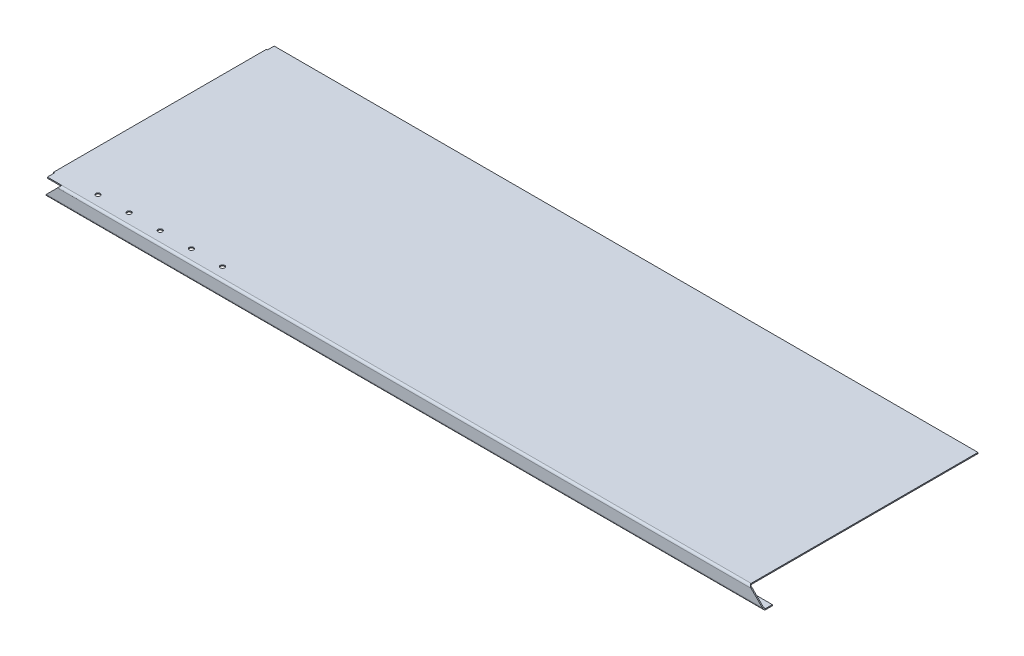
ISO-10303-21;
HEADER;
FILE_DESCRIPTION(('STEP AP214'),'2;1');
FILE_NAME('part.step','',(''),(''),'','','');
FILE_SCHEMA(('AUTOMOTIVE_DESIGN { 1 0 10303 214 1 1 1 1 }'));
ENDSEC;
DATA;
#1=APPLICATION_CONTEXT('core data for automotive mechanical design processes');
#2=APPLICATION_PROTOCOL_DEFINITION('international standard','automotive_design',2000,#1);
#3=PRODUCT_CONTEXT('',#1,'mechanical');
#4=PRODUCT('Part','Part','',(#3));
#5=PRODUCT_RELATED_PRODUCT_CATEGORY('part','',(#4));
#6=PRODUCT_DEFINITION_FORMATION('','',#4);
#7=PRODUCT_DEFINITION_CONTEXT('part definition',#1,'design');
#8=PRODUCT_DEFINITION('design','',#6,#7);
#9=PRODUCT_DEFINITION_SHAPE('','',#8);
#10=(LENGTH_UNIT() NAMED_UNIT(*) SI_UNIT(.MILLI.,.METRE.));
#11=(NAMED_UNIT(*) PLANE_ANGLE_UNIT() SI_UNIT($,.RADIAN.));
#12=(NAMED_UNIT(*) SI_UNIT($,.STERADIAN.) SOLID_ANGLE_UNIT());
#13=UNCERTAINTY_MEASURE_WITH_UNIT(LENGTH_MEASURE(1.E-05),#10,'distance_accuracy_value','');
#14=(GEOMETRIC_REPRESENTATION_CONTEXT(3) GLOBAL_UNCERTAINTY_ASSIGNED_CONTEXT((#13)) GLOBAL_UNIT_ASSIGNED_CONTEXT((#10,
#11,#12)) REPRESENTATION_CONTEXT('',''));
#15=CARTESIAN_POINT('',(0.,0.,0.));
#16=DIRECTION('',(0.,0.,1.));
#17=DIRECTION('',(1.,0.,0.));
#18=AXIS2_PLACEMENT_3D('',#15,#16,#17);
#19=CARTESIAN_POINT('',(0.,-3.048,0.));
#20=DIRECTION('',(0.,1.,0.));
#21=DIRECTION('',(0.,0.,1.));
#22=AXIS2_PLACEMENT_3D('',#19,#20,#21);
#23=PLANE('',#22);
#24=CARTESIAN_POINT('',(119.0625,-3.048,619.125));
#25=DIRECTION('',(0.,1.,0.));
#26=DIRECTION('',(0.,0.,1.));
#27=AXIS2_PLACEMENT_3D('',#24,#25,#26);
#28=CIRCLE('',#27,6.34999999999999);
#29=CARTESIAN_POINT('',(119.0625,-3.048,625.475));
#30=VERTEX_POINT('',#29);
#31=EDGE_CURVE('E878',#30,#30,#28,.T.);
#32=ORIENTED_EDGE('',*,*,#31,.T.);
#33=EDGE_LOOP('',(#32));
#34=FACE_BOUND('',#33,.T.);
#35=CARTESIAN_POINT('',(474.6625,-3.04800000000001,619.125));
#36=DIRECTION('',(0.,1.,0.));
#37=DIRECTION('',(0.,0.,1.));
#38=AXIS2_PLACEMENT_3D('',#35,#36,#37);
#39=CIRCLE('',#38,6.34999999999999);
#40=CARTESIAN_POINT('',(474.6625,-3.04800000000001,625.475));
#41=VERTEX_POINT('',#40);
#42=EDGE_CURVE('E887',#41,#41,#39,.T.);
#43=ORIENTED_EDGE('',*,*,#42,.T.);
#44=EDGE_LOOP('',(#43));
#45=FACE_BOUND('',#44,.T.);
#46=CARTESIAN_POINT('',(385.7625,-3.04800000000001,619.125));
#47=DIRECTION('',(0.,1.,0.));
#48=DIRECTION('',(0.,0.,1.));
#49=AXIS2_PLACEMENT_3D('',#46,#47,#48);
#50=CIRCLE('',#49,6.34999999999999);
#51=CARTESIAN_POINT('',(385.7625,-3.04800000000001,625.475));
#52=VERTEX_POINT('',#51);
#53=EDGE_CURVE('E897',#52,#52,#50,.T.);
#54=ORIENTED_EDGE('',*,*,#53,.T.);
#55=EDGE_LOOP('',(#54));
#56=FACE_BOUND('',#55,.T.);
#57=CARTESIAN_POINT('',(296.8625,-3.048,619.125));
#58=DIRECTION('',(0.,1.,0.));
#59=DIRECTION('',(0.,0.,1.));
#60=AXIS2_PLACEMENT_3D('',#57,#58,#59);
#61=CIRCLE('',#60,6.34999999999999);
#62=CARTESIAN_POINT('',(296.8625,-3.048,625.475));
#63=VERTEX_POINT('',#62);
#64=EDGE_CURVE('E896',#63,#63,#61,.T.);
#65=ORIENTED_EDGE('',*,*,#64,.T.);
#66=EDGE_LOOP('',(#65));
#67=FACE_BOUND('',#66,.T.);
#68=CARTESIAN_POINT('',(207.9625,-3.048,619.125));
#69=DIRECTION('',(0.,1.,0.));
#70=DIRECTION('',(0.,0.,1.));
#71=AXIS2_PLACEMENT_3D('',#68,#69,#70);
#72=CIRCLE('',#71,6.34999999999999);
#73=CARTESIAN_POINT('',(207.9625,-3.048,625.475));
#74=VERTEX_POINT('',#73);
#75=EDGE_CURVE('E258',#74,#74,#72,.T.);
#76=ORIENTED_EDGE('',*,*,#75,.T.);
#77=EDGE_LOOP('',(#76));
#78=FACE_BOUND('',#77,.T.);
#79=DIRECTION('',(-1.,0.,0.));
#80=VECTOR('',#79,1.);
#81=CARTESIAN_POINT('',(0.,-3.048,627.1895));
#82=LINE('',#81,#80);
#83=CARTESIAN_POINT('',(3.04800000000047,-3.048,627.1895));
#84=VERTEX_POINT('',#83);
#85=CARTESIAN_POINT('',(4.64905891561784E-13,-3.048,627.1895));
#86=VERTEX_POINT('',#85);
#87=EDGE_CURVE('E219',#84,#86,#82,.T.);
#88=ORIENTED_EDGE('',*,*,#87,.T.);
#89=DIRECTION('',(0.,0.,1.));
#90=VECTOR('',#89,1.);
#91=CARTESIAN_POINT('',(4.64905891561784E-13,-3.048,0.));
#92=LINE('',#91,#90);
#93=CARTESIAN_POINT('',(4.64905891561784E-13,-3.048,19.05));
#94=VERTEX_POINT('',#93);
#95=EDGE_CURVE('E245',#94,#86,#92,.T.);
#96=ORIENTED_EDGE('',*,*,#95,.F.);
#97=DIRECTION('',(1.,0.,0.));
#98=VECTOR('',#97,1.);
#99=CARTESIAN_POINT('',(0.,-3.048,19.05));
#100=LINE('',#99,#98);
#101=CARTESIAN_POINT('',(3.04800000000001,-3.048,19.05));
#102=VERTEX_POINT('',#101);
#103=EDGE_CURVE('E112',#94,#102,#100,.T.);
#104=ORIENTED_EDGE('',*,*,#103,.T.);
#105=DIRECTION('',(0.,0.,-1.));
#106=VECTOR('',#105,1.);
#107=CARTESIAN_POINT('',(3.048,-3.048,0.));
#108=LINE('',#107,#106);
#109=CARTESIAN_POINT('',(3.048,-3.048,0.));
#110=VERTEX_POINT('',#109);
#111=EDGE_CURVE('E254',#102,#110,#108,.T.);
#112=ORIENTED_EDGE('',*,*,#111,.T.);
#113=DIRECTION('',(-1.,0.,0.));
#114=VECTOR('',#113,1.);
#115=CARTESIAN_POINT('',(0.,-3.048,0.));
#116=LINE('',#115,#114);
#117=CARTESIAN_POINT('',(2012.95,-3.048,0.));
#118=VERTEX_POINT('',#117);
#119=EDGE_CURVE('E13',#118,#110,#116,.T.);
#120=ORIENTED_EDGE('',*,*,#119,.F.);
#121=DIRECTION('',(0.,0.,1.));
#122=VECTOR('',#121,1.);
#123=CARTESIAN_POINT('',(2012.95,-3.048,0.));
#124=LINE('',#123,#122);
#125=CARTESIAN_POINT('',(2012.95,-3.04800000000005,647.827));
#126=VERTEX_POINT('',#125);
#127=EDGE_CURVE('E327',#126,#118,#124,.F.);
#128=ORIENTED_EDGE('',*,*,#127,.F.);
#129=DIRECTION('',(-1.,0.,0.));
#130=VECTOR('',#129,1.);
#131=CARTESIAN_POINT('',(0.,-3.04800000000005,647.827));
#132=LINE('',#131,#130);
#133=CARTESIAN_POINT('',(44.4500000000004,-3.048,647.827));
#134=VERTEX_POINT('',#133);
#135=EDGE_CURVE('E418',#134,#126,#132,.F.);
#136=ORIENTED_EDGE('',*,*,#135,.F.);
#137=DIRECTION('',(1.,0.,0.));
#138=VECTOR('',#137,1.);
#139=CARTESIAN_POINT('',(4.64905891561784E-13,-3.048,647.827));
#140=LINE('',#139,#138);
#141=CARTESIAN_POINT('',(3.04800000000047,-3.048,647.827));
#142=VERTEX_POINT('',#141);
#143=EDGE_CURVE('E278',#142,#134,#140,.T.);
#144=ORIENTED_EDGE('',*,*,#143,.F.);
#145=DIRECTION('',(0.,0.,-1.));
#146=VECTOR('',#145,1.);
#147=CARTESIAN_POINT('',(3.04800000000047,-3.048,0.));
#148=LINE('',#147,#146);
#149=EDGE_CURVE('E238',#142,#84,#148,.T.);
#150=ORIENTED_EDGE('',*,*,#149,.T.);
#151=EDGE_LOOP('',(#88,#96,#104,#112,#120,#128,#136,#144,#150));
#152=FACE_BOUND('',#151,.T.);
#153=ADVANCED_FACE('F88',(#34,#45,#56,#67,#78,#152),#23,.F.);
#154=CARTESIAN_POINT('',(0.,0.,0.));
#155=DIRECTION('',(0.,1.,0.));
#156=DIRECTION('',(0.,0.,1.));
#157=AXIS2_PLACEMENT_3D('',#154,#155,#156);
#158=PLANE('',#157);
#159=CARTESIAN_POINT('',(119.0625,0.,619.125));
#160=DIRECTION('',(0.,1.,0.));
#161=DIRECTION('',(0.,0.,1.));
#162=AXIS2_PLACEMENT_3D('',#159,#160,#161);
#163=CIRCLE('',#162,6.34999999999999);
#164=CARTESIAN_POINT('',(119.0625,0.,625.475));
#165=VERTEX_POINT('',#164);
#166=EDGE_CURVE('E876',#165,#165,#163,.T.);
#167=ORIENTED_EDGE('',*,*,#166,.F.);
#168=EDGE_LOOP('',(#167));
#169=FACE_BOUND('',#168,.T.);
#170=CARTESIAN_POINT('',(474.6625,0.,619.125));
#171=DIRECTION('',(0.,1.,0.));
#172=DIRECTION('',(0.,0.,1.));
#173=AXIS2_PLACEMENT_3D('',#170,#171,#172);
#174=CIRCLE('',#173,6.34999999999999);
#175=CARTESIAN_POINT('',(474.6625,0.,625.475));
#176=VERTEX_POINT('',#175);
#177=EDGE_CURVE('E880',#176,#176,#174,.T.);
#178=ORIENTED_EDGE('',*,*,#177,.F.);
#179=EDGE_LOOP('',(#178));
#180=FACE_BOUND('',#179,.T.);
#181=CARTESIAN_POINT('',(385.7625,0.,619.125));
#182=DIRECTION('',(0.,1.,0.));
#183=DIRECTION('',(0.,0.,1.));
#184=AXIS2_PLACEMENT_3D('',#181,#182,#183);
#185=CIRCLE('',#184,6.34999999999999);
#186=CARTESIAN_POINT('',(385.7625,0.,625.475));
#187=VERTEX_POINT('',#186);
#188=EDGE_CURVE('E917',#187,#187,#185,.T.);
#189=ORIENTED_EDGE('',*,*,#188,.F.);
#190=EDGE_LOOP('',(#189));
#191=FACE_BOUND('',#190,.T.);
#192=CARTESIAN_POINT('',(296.8625,0.,619.125));
#193=DIRECTION('',(0.,1.,0.));
#194=DIRECTION('',(0.,0.,1.));
#195=AXIS2_PLACEMENT_3D('',#192,#193,#194);
#196=CIRCLE('',#195,6.34999999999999);
#197=CARTESIAN_POINT('',(296.8625,0.,625.475));
#198=VERTEX_POINT('',#197);
#199=EDGE_CURVE('E892',#198,#198,#196,.T.);
#200=ORIENTED_EDGE('',*,*,#199,.F.);
#201=EDGE_LOOP('',(#200));
#202=FACE_BOUND('',#201,.T.);
#203=CARTESIAN_POINT('',(207.9625,0.,619.125));
#204=DIRECTION('',(0.,1.,0.));
#205=DIRECTION('',(0.,0.,1.));
#206=AXIS2_PLACEMENT_3D('',#203,#204,#205);
#207=CIRCLE('',#206,6.34999999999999);
#208=CARTESIAN_POINT('',(207.9625,0.,625.475));
#209=VERTEX_POINT('',#208);
#210=EDGE_CURVE('E901',#209,#209,#207,.T.);
#211=ORIENTED_EDGE('',*,*,#210,.F.);
#212=EDGE_LOOP('',(#211));
#213=FACE_BOUND('',#212,.T.);
#214=DIRECTION('',(0.,0.,-1.));
#215=VECTOR('',#214,1.);
#216=CARTESIAN_POINT('',(4.64905891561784E-13,0.,0.));
#217=LINE('',#216,#215);
#218=CARTESIAN_POINT('',(4.64905891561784E-13,0.,627.1895));
#219=VERTEX_POINT('',#218);
#220=CARTESIAN_POINT('',(4.64905891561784E-13,0.,19.05));
#221=VERTEX_POINT('',#220);
#222=EDGE_CURVE('E230',#219,#221,#217,.T.);
#223=ORIENTED_EDGE('',*,*,#222,.F.);
#224=DIRECTION('',(1.,0.,0.));
#225=VECTOR('',#224,1.);
#226=CARTESIAN_POINT('',(0.,0.,627.1895));
#227=LINE('',#226,#225);
#228=CARTESIAN_POINT('',(3.04800000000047,0.,627.1895));
#229=VERTEX_POINT('',#228);
#230=EDGE_CURVE('E104',#229,#219,#227,.F.);
#231=ORIENTED_EDGE('',*,*,#230,.F.);
#232=DIRECTION('',(0.,0.,1.));
#233=VECTOR('',#232,1.);
#234=CARTESIAN_POINT('',(3.04800000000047,0.,0.));
#235=LINE('',#234,#233);
#236=CARTESIAN_POINT('',(3.04800000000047,0.,647.827));
#237=VERTEX_POINT('',#236);
#238=EDGE_CURVE('E210',#237,#229,#235,.F.);
#239=ORIENTED_EDGE('',*,*,#238,.F.);
#240=DIRECTION('',(1.,0.,0.));
#241=VECTOR('',#240,1.);
#242=CARTESIAN_POINT('',(4.64905891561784E-13,0.,647.827));
#243=LINE('',#242,#241);
#244=CARTESIAN_POINT('',(44.4500000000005,0.,647.827));
#245=VERTEX_POINT('',#244);
#246=EDGE_CURVE('E275',#237,#245,#243,.T.);
#247=ORIENTED_EDGE('',*,*,#246,.T.);
#248=DIRECTION('',(-1.,0.,0.));
#249=VECTOR('',#248,1.);
#250=CARTESIAN_POINT('',(0.,0.,647.827));
#251=LINE('',#250,#249);
#252=CARTESIAN_POINT('',(2012.95,0.,647.827));
#253=VERTEX_POINT('',#252);
#254=EDGE_CURVE('E421',#245,#253,#251,.F.);
#255=ORIENTED_EDGE('',*,*,#254,.T.);
#256=DIRECTION('',(0.,0.,-1.));
#257=VECTOR('',#256,1.);
#258=CARTESIAN_POINT('',(2012.95,0.,3349.56692193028));
#259=LINE('',#258,#257);
#260=CARTESIAN_POINT('',(2012.95,-1.11022302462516E-13,0.));
#261=VERTEX_POINT('',#260);
#262=EDGE_CURVE('E310',#253,#261,#259,.T.);
#263=ORIENTED_EDGE('',*,*,#262,.T.);
#264=DIRECTION('',(-1.,0.,0.));
#265=VECTOR('',#264,1.);
#266=CARTESIAN_POINT('',(0.,0.,0.));
#267=LINE('',#266,#265);
#268=CARTESIAN_POINT('',(3.048,0.,0.));
#269=VERTEX_POINT('',#268);
#270=EDGE_CURVE('E92',#261,#269,#267,.T.);
#271=ORIENTED_EDGE('',*,*,#270,.T.);
#272=DIRECTION('',(0.,0.,1.));
#273=VECTOR('',#272,1.);
#274=CARTESIAN_POINT('',(3.04800000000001,0.,0.));
#275=LINE('',#274,#273);
#276=CARTESIAN_POINT('',(3.04800000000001,0.,19.05));
#277=VERTEX_POINT('',#276);
#278=EDGE_CURVE('E247',#277,#269,#275,.F.);
#279=ORIENTED_EDGE('',*,*,#278,.F.);
#280=DIRECTION('',(1.,0.,0.));
#281=VECTOR('',#280,1.);
#282=CARTESIAN_POINT('',(0.,0.,19.05));
#283=LINE('',#282,#281);
#284=EDGE_CURVE('E250',#221,#277,#283,.T.);
#285=ORIENTED_EDGE('',*,*,#284,.F.);
#286=EDGE_LOOP('',(#223,#231,#239,#247,#255,#263,#271,#279,#285));
#287=FACE_BOUND('',#286,.T.);
#288=ADVANCED_FACE('F227',(#169,#180,#191,#202,#213,#287),#158,.T.);
#289=CARTESIAN_POINT('',(0.,-3.048,0.));
#290=DIRECTION('',(0.,0.,-1.));
#291=DIRECTION('',(-1.,0.,0.));
#292=AXIS2_PLACEMENT_3D('',#289,#290,#291);
#293=PLANE('',#292);
#294=ORIENTED_EDGE('',*,*,#119,.T.);
#295=DIRECTION('',(0.,-1.,0.));
#296=VECTOR('',#295,1.);
#297=CARTESIAN_POINT('',(3.048,-3.048,0.));
#298=LINE('',#297,#296);
#299=EDGE_CURVE('E261',#110,#269,#298,.F.);
#300=ORIENTED_EDGE('',*,*,#299,.T.);
#301=ORIENTED_EDGE('',*,*,#270,.F.);
#302=DIRECTION('',(0.,1.,0.));
#303=VECTOR('',#302,1.);
#304=CARTESIAN_POINT('',(2012.95,-1.11022302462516E-13,0.));
#305=LINE('',#304,#303);
#306=EDGE_CURVE('E330',#261,#118,#305,.F.);
#307=ORIENTED_EDGE('',*,*,#306,.T.);
#308=EDGE_LOOP('',(#294,#300,#301,#307));
#309=FACE_BOUND('',#308,.T.);
#310=ADVANCED_FACE('F90',(#309),#293,.T.);
#311=CARTESIAN_POINT('',(4.64905891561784E-13,0.,647.827));
#312=DIRECTION('',(0.,0.,-1.));
#313=DIRECTION('',(-1.,0.,0.));
#314=AXIS2_PLACEMENT_3D('',#311,#312,#313);
#315=PLANE('',#314);
#316=DIRECTION('',(0.,-1.,0.));
#317=VECTOR('',#316,1.);
#318=CARTESIAN_POINT('',(3.04800000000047,-3.048,647.827));
#319=LINE('',#318,#317);
#320=EDGE_CURVE('E215',#142,#237,#319,.F.);
#321=ORIENTED_EDGE('',*,*,#320,.F.);
#322=ORIENTED_EDGE('',*,*,#143,.T.);
#323=DIRECTION('',(0.,1.,0.));
#324=VECTOR('',#323,1.);
#325=CARTESIAN_POINT('',(44.4500000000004,0.,647.827));
#326=LINE('',#325,#324);
#327=EDGE_CURVE('E346',#245,#134,#326,.F.);
#328=ORIENTED_EDGE('',*,*,#327,.F.);
#329=ORIENTED_EDGE('',*,*,#246,.F.);
#330=EDGE_LOOP('',(#321,#322,#328,#329));
#331=FACE_BOUND('',#330,.T.);
#332=ADVANCED_FACE('F615',(#331),#315,.F.);
#333=CARTESIAN_POINT('',(4.64905891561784E-13,0.,0.));
#334=DIRECTION('',(-1.,0.,0.));
#335=DIRECTION('',(0.,0.,1.));
#336=AXIS2_PLACEMENT_3D('',#333,#334,#335);
#337=PLANE('',#336);
#338=ORIENTED_EDGE('',*,*,#95,.T.);
#339=DIRECTION('',(0.,-1.,0.));
#340=VECTOR('',#339,1.);
#341=CARTESIAN_POINT('',(4.64905891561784E-13,-3.048,627.1895));
#342=LINE('',#341,#340);
#343=EDGE_CURVE('E224',#86,#219,#342,.F.);
#344=ORIENTED_EDGE('',*,*,#343,.T.);
#345=ORIENTED_EDGE('',*,*,#222,.T.);
#346=DIRECTION('',(0.,-1.,0.));
#347=VECTOR('',#346,1.);
#348=CARTESIAN_POINT('',(4.64905891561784E-13,-3.048,19.05));
#349=LINE('',#348,#347);
#350=EDGE_CURVE('E241',#94,#221,#349,.F.);
#351=ORIENTED_EDGE('',*,*,#350,.F.);
#352=EDGE_LOOP('',(#338,#344,#345,#351));
#353=FACE_BOUND('',#352,.T.);
#354=ADVANCED_FACE('F526',(#353),#337,.T.);
#355=CARTESIAN_POINT('',(0.,1.76452196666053E-12,654.05));
#356=DIRECTION('',(0.,0.,-1.));
#357=DIRECTION('',(0.,1.,0.));
#358=AXIS2_PLACEMENT_3D('',#355,#356,#357);
#359=PLANE('',#358);
#360=DIRECTION('',(-0.707106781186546,0.707106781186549,0.));
#361=VECTOR('',#360,1.);
#362=CARTESIAN_POINT('',(1006.475,1006.475,654.049999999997));
#363=LINE('',#362,#361);
#364=CARTESIAN_POINT('',(2051.177,-38.227,654.05));
#365=VERTEX_POINT('',#364);
#366=CARTESIAN_POINT('',(2019.173,-6.22300000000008,654.05));
#367=VERTEX_POINT('',#366);
#368=EDGE_CURVE('E297',#365,#367,#363,.T.);
#369=ORIENTED_EDGE('',*,*,#368,.T.);
#370=DIRECTION('',(-1.,0.,0.));
#371=VECTOR('',#370,1.);
#372=CARTESIAN_POINT('',(2057.4,-6.22300000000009,654.05));
#373=LINE('',#372,#371);
#374=CARTESIAN_POINT('',(38.2270000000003,-6.22300000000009,654.05));
#375=VERTEX_POINT('',#374);
#376=EDGE_CURVE('E414',#375,#367,#373,.F.);
#377=ORIENTED_EDGE('',*,*,#376,.F.);
#378=DIRECTION('',(0.707106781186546,0.707106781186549,0.));
#379=VECTOR('',#378,1.);
#380=CARTESIAN_POINT('',(22.2250000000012,-22.2249999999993,654.05));
#381=LINE('',#380,#379);
#382=CARTESIAN_POINT('',(6.22300000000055,-38.227,654.05));
#383=VERTEX_POINT('',#382);
#384=EDGE_CURVE('E371',#383,#375,#381,.T.);
#385=ORIENTED_EDGE('',*,*,#384,.F.);
#386=DIRECTION('',(-1.,0.,0.));
#387=VECTOR('',#386,1.);
#388=CARTESIAN_POINT('',(4.44089209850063E-13,-38.227,654.05));
#389=LINE('',#388,#387);
#390=EDGE_CURVE('E406',#383,#365,#389,.F.);
#391=ORIENTED_EDGE('',*,*,#390,.T.);
#392=EDGE_LOOP('',(#369,#377,#385,#391));
#393=FACE_BOUND('',#392,.T.);
#394=ADVANCED_FACE('F458',(#393),#359,.F.);
#395=CARTESIAN_POINT('',(0.,1.75387993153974E-12,651.002));
#396=DIRECTION('',(0.,0.,-1.));
#397=DIRECTION('',(0.,1.,0.));
#398=AXIS2_PLACEMENT_3D('',#395,#396,#397);
#399=PLANE('',#398);
#400=DIRECTION('',(-1.,0.,0.));
#401=VECTOR('',#400,1.);
#402=CARTESIAN_POINT('',(2057.4,-6.22300000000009,651.002));
#403=LINE('',#402,#401);
#404=CARTESIAN_POINT('',(2019.173,-6.22300000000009,651.002));
#405=VERTEX_POINT('',#404);
#406=CARTESIAN_POINT('',(38.2270000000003,-6.22300000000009,651.002));
#407=VERTEX_POINT('',#406);
#408=EDGE_CURVE('E410',#405,#407,#403,.T.);
#409=ORIENTED_EDGE('',*,*,#408,.F.);
#410=DIRECTION('',(-0.707106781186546,0.707106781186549,0.));
#411=VECTOR('',#410,1.);
#412=CARTESIAN_POINT('',(1006.475,1006.475,651.001999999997));
#413=LINE('',#412,#411);
#414=CARTESIAN_POINT('',(2051.177,-38.227,651.002));
#415=VERTEX_POINT('',#414);
#416=EDGE_CURVE('E302',#415,#405,#413,.T.);
#417=ORIENTED_EDGE('',*,*,#416,.F.);
#418=DIRECTION('',(-1.,0.,0.));
#419=VECTOR('',#418,1.);
#420=CARTESIAN_POINT('',(4.44089209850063E-13,-38.227,651.002));
#421=LINE('',#420,#419);
#422=CARTESIAN_POINT('',(6.22300000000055,-38.227,651.002));
#423=VERTEX_POINT('',#422);
#424=EDGE_CURVE('E397',#423,#415,#421,.F.);
#425=ORIENTED_EDGE('',*,*,#424,.F.);
#426=DIRECTION('',(0.707106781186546,0.707106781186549,0.));
#427=VECTOR('',#426,1.);
#428=CARTESIAN_POINT('',(22.2250000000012,-22.2249999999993,651.002));
#429=LINE('',#428,#427);
#430=EDGE_CURVE('E378',#423,#407,#429,.T.);
#431=ORIENTED_EDGE('',*,*,#430,.T.);
#432=EDGE_LOOP('',(#409,#417,#425,#431));
#433=FACE_BOUND('',#432,.T.);
#434=ADVANCED_FACE('F489',(#433),#399,.T.);
#435=CARTESIAN_POINT('',(0.,-6.22300000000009,647.827));
#436=DIRECTION('',(-1.,0.,0.));
#437=DIRECTION('',(0.,0.,1.));
#438=AXIS2_PLACEMENT_3D('',#435,#436,#437);
#439=CYLINDRICAL_SURFACE('',#438,6.22300000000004);
#440=ORIENTED_EDGE('',*,*,#376,.T.);
#441=CARTESIAN_POINT('',(2019.173,-6.22300000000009,647.827));
#442=DIRECTION('',(-0.707106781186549,-0.707106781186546,0.));
#443=DIRECTION('',(-0.707106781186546,0.707106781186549,0.));
#444=AXIS2_PLACEMENT_3D('',#441,#442,#443);
#445=ELLIPSE('',#444,8.80065099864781,6.22300000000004);
#446=EDGE_CURVE('E287',#253,#367,#445,.F.);
#447=ORIENTED_EDGE('',*,*,#446,.F.);
#448=ORIENTED_EDGE('',*,*,#254,.F.);
#449=CARTESIAN_POINT('',(38.2270000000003,-6.22300000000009,647.827));
#450=DIRECTION('',(-0.707106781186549,0.707106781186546,0.));
#451=DIRECTION('',(-0.707106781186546,-0.707106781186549,0.));
#452=AXIS2_PLACEMENT_3D('',#449,#450,#451);
#453=ELLIPSE('',#452,8.80065099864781,6.22300000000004);
#454=EDGE_CURVE('E347',#245,#375,#453,.F.);
#455=ORIENTED_EDGE('',*,*,#454,.T.);
#456=EDGE_LOOP('',(#440,#447,#448,#455));
#457=FACE_BOUND('',#456,.T.);
#458=ADVANCED_FACE('F453',(#457),#439,.T.);
#459=CARTESIAN_POINT('',(0.,-6.22300000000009,647.827));
#460=DIRECTION('',(-1.,0.,0.));
#461=DIRECTION('',(0.,0.,1.));
#462=AXIS2_PLACEMENT_3D('',#459,#460,#461);
#463=CYLINDRICAL_SURFACE('',#462,3.17500000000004);
#464=CARTESIAN_POINT('',(2019.173,-6.22300000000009,647.827));
#465=DIRECTION('',(-0.454470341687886,-0.890761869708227,0.));
#466=DIRECTION('',(-0.890761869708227,0.454470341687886,0.));
#467=AXIS2_PLACEMENT_3D('',#464,#465,#466);
#468=ELLIPSE('',#467,6.98615445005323,3.17500000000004);
#469=EDGE_CURVE('E282',#126,#405,#468,.F.);
#470=ORIENTED_EDGE('',*,*,#469,.T.);
#471=ORIENTED_EDGE('',*,*,#408,.T.);
#472=CARTESIAN_POINT('',(38.2270000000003,-6.22300000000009,647.827));
#473=DIRECTION('',(-0.454470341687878,0.890761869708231,0.));
#474=DIRECTION('',(-0.890761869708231,-0.454470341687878,0.));
#475=AXIS2_PLACEMENT_3D('',#472,#473,#474);
#476=ELLIPSE('',#475,6.98615445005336,3.17500000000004);
#477=EDGE_CURVE('E342',#134,#407,#476,.F.);
#478=ORIENTED_EDGE('',*,*,#477,.F.);
#479=ORIENTED_EDGE('',*,*,#135,.T.);
#480=EDGE_LOOP('',(#470,#471,#478,#479));
#481=FACE_BOUND('',#480,.T.);
#482=ADVANCED_FACE('F431',(#481),#463,.F.);
#483=CARTESIAN_POINT('',(4.44089209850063E-13,-38.227,647.827));
#484=DIRECTION('',(-1.,0.,0.));
#485=DIRECTION('',(0.,-1.,0.));
#486=AXIS2_PLACEMENT_3D('',#483,#484,#485);
#487=CYLINDRICAL_SURFACE('',#486,6.22299999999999);
#488=DIRECTION('',(-1.,0.,0.));
#489=VECTOR('',#488,1.);
#490=CARTESIAN_POINT('',(0.,-44.45,647.827));
#491=LINE('',#490,#489);
#492=CARTESIAN_POINT('',(2054.352,-44.45,647.827));
#493=VERTEX_POINT('',#492);
#494=CARTESIAN_POINT('',(3.04800000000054,-44.45,647.827));
#495=VERTEX_POINT('',#494);
#496=EDGE_CURVE('E401',#493,#495,#491,.T.);
#497=ORIENTED_EDGE('',*,*,#496,.F.);
#498=CARTESIAN_POINT('',(2051.177,-38.227,647.827));
#499=DIRECTION('',(-0.890761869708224,-0.454470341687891,0.));
#500=DIRECTION('',(-0.454470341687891,0.890761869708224,0.));
#501=AXIS2_PLACEMENT_3D('',#498,#499,#500);
#502=ELLIPSE('',#501,6.9861544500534,6.22299999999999);
#503=EDGE_CURVE('E291',#365,#493,#502,.F.);
#504=ORIENTED_EDGE('',*,*,#503,.F.);
#505=ORIENTED_EDGE('',*,*,#390,.F.);
#506=CARTESIAN_POINT('',(6.22300000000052,-38.227,647.827));
#507=DIRECTION('',(-0.890761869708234,0.454470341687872,0.));
#508=DIRECTION('',(-0.454470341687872,-0.890761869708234,0.));
#509=AXIS2_PLACEMENT_3D('',#506,#507,#508);
#510=ELLIPSE('',#509,6.98615445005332,6.22299999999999);
#511=EDGE_CURVE('E351',#383,#495,#510,.F.);
#512=ORIENTED_EDGE('',*,*,#511,.T.);
#513=EDGE_LOOP('',(#497,#504,#505,#512));
#514=FACE_BOUND('',#513,.T.);
#515=ADVANCED_FACE('F469',(#514),#487,.T.);
#516=CARTESIAN_POINT('',(4.44089209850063E-13,-38.227,647.827));
#517=DIRECTION('',(-1.,0.,0.));
#518=DIRECTION('',(0.,-1.,0.));
#519=AXIS2_PLACEMENT_3D('',#516,#517,#518);
#520=CYLINDRICAL_SURFACE('',#519,3.17499999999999);
#521=CARTESIAN_POINT('',(2051.177,-38.227,647.827));
#522=DIRECTION('',(-0.707106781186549,-0.707106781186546,0.));
#523=DIRECTION('',(-0.707106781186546,0.707106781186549,0.));
#524=AXIS2_PLACEMENT_3D('',#521,#522,#523);
#525=ELLIPSE('',#524,4.49012806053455,3.17499999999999);
#526=CARTESIAN_POINT('',(2054.352,-41.402,647.827));
#527=VERTEX_POINT('',#526);
#528=EDGE_CURVE('E281',#415,#527,#525,.F.);
#529=ORIENTED_EDGE('',*,*,#528,.T.);
#530=DIRECTION('',(1.,0.,0.));
#531=VECTOR('',#530,1.);
#532=CARTESIAN_POINT('',(2057.4,-41.402,647.827));
#533=LINE('',#532,#531);
#534=CARTESIAN_POINT('',(3.04800000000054,-41.402,647.827));
#535=VERTEX_POINT('',#534);
#536=EDGE_CURVE('E390',#527,#535,#533,.F.);
#537=ORIENTED_EDGE('',*,*,#536,.T.);
#538=CARTESIAN_POINT('',(6.22300000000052,-38.227,647.827));
#539=DIRECTION('',(-0.707106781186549,0.707106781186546,0.));
#540=DIRECTION('',(-0.707106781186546,-0.707106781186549,0.));
#541=AXIS2_PLACEMENT_3D('',#538,#539,#540);
#542=ELLIPSE('',#541,4.49012806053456,3.17499999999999);
#543=EDGE_CURVE('E338',#423,#535,#542,.F.);
#544=ORIENTED_EDGE('',*,*,#543,.F.);
#545=ORIENTED_EDGE('',*,*,#424,.T.);
#546=EDGE_LOOP('',(#529,#537,#544,#545));
#547=FACE_BOUND('',#546,.T.);
#548=ADVANCED_FACE('F486',(#547),#520,.F.);
#549=CARTESIAN_POINT('',(0.,-44.450000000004,2.86620769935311E-13));
#550=DIRECTION('',(0.,-1.,0.));
#551=DIRECTION('',(0.,0.,-1.));
#552=AXIS2_PLACEMENT_3D('',#549,#550,#551);
#553=PLANE('',#552);
#554=DIRECTION('',(-1.,0.,0.));
#555=VECTOR('',#554,1.);
#556=CARTESIAN_POINT('',(0.,-44.4500000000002,628.65));
#557=LINE('',#556,#555);
#558=CARTESIAN_POINT('',(2054.352,-44.4500000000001,628.65));
#559=VERTEX_POINT('',#558);
#560=CARTESIAN_POINT('',(3.04800000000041,-44.4500000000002,628.65));
#561=VERTEX_POINT('',#560);
#562=EDGE_CURVE('E394',#559,#561,#557,.T.);
#563=ORIENTED_EDGE('',*,*,#562,.F.);
#564=DIRECTION('',(0.,0.,-1.));
#565=VECTOR('',#564,1.);
#566=CARTESIAN_POINT('',(2054.352,-44.450000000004,2.86729569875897E-13));
#567=LINE('',#566,#565);
#568=EDGE_CURVE('E314',#493,#559,#567,.T.);
#569=ORIENTED_EDGE('',*,*,#568,.F.);
#570=ORIENTED_EDGE('',*,*,#496,.T.);
#571=DIRECTION('',(0.,0.,-1.));
#572=VECTOR('',#571,1.);
#573=CARTESIAN_POINT('',(3.04800000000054,-44.450000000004,2.86729569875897E-13));
#574=LINE('',#573,#572);
#575=EDGE_CURVE('E358',#495,#561,#574,.T.);
#576=ORIENTED_EDGE('',*,*,#575,.T.);
#577=EDGE_LOOP('',(#563,#569,#570,#576));
#578=FACE_BOUND('',#577,.T.);
#579=ADVANCED_FACE('F475',(#578),#553,.T.);
#580=CARTESIAN_POINT('',(0.,-41.402000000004,2.67805313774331E-13));
#581=DIRECTION('',(0.,-1.,0.));
#582=DIRECTION('',(0.,0.,-1.));
#583=AXIS2_PLACEMENT_3D('',#580,#581,#582);
#584=PLANE('',#583);
#585=DIRECTION('',(0.,0.,-1.));
#586=VECTOR('',#585,1.);
#587=CARTESIAN_POINT('',(2054.352,-41.402000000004,1.30227539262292E-11));
#588=LINE('',#587,#586);
#589=CARTESIAN_POINT('',(2054.352,-41.4020000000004,628.65));
#590=VERTEX_POINT('',#589);
#591=EDGE_CURVE('E286',#527,#590,#588,.T.);
#592=ORIENTED_EDGE('',*,*,#591,.T.);
#593=DIRECTION('',(1.,0.,0.));
#594=VECTOR('',#593,1.);
#595=CARTESIAN_POINT('',(0.,-41.4020000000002,628.65));
#596=LINE('',#595,#594);
#597=CARTESIAN_POINT('',(3.04800000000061,-41.4020000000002,628.65));
#598=VERTEX_POINT('',#597);
#599=EDGE_CURVE('E398',#590,#598,#596,.F.);
#600=ORIENTED_EDGE('',*,*,#599,.T.);
#601=DIRECTION('',(0.,0.,-1.));
#602=VECTOR('',#601,1.);
#603=CARTESIAN_POINT('',(3.04799999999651,-41.402000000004,2.48881057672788E-13));
#604=LINE('',#603,#602);
#605=EDGE_CURVE('E363',#535,#598,#604,.T.);
#606=ORIENTED_EDGE('',*,*,#605,.F.);
#607=ORIENTED_EDGE('',*,*,#536,.F.);
#608=EDGE_LOOP('',(#592,#600,#606,#607));
#609=FACE_BOUND('',#608,.T.);
#610=ADVANCED_FACE('F503',(#609),#584,.F.);
#611=CARTESIAN_POINT('',(0.,-44.4500000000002,628.65));
#612=DIRECTION('',(0.,0.,-1.));
#613=DIRECTION('',(0.,1.,0.));
#614=AXIS2_PLACEMENT_3D('',#611,#612,#613);
#615=PLANE('',#614);
#616=ORIENTED_EDGE('',*,*,#599,.F.);
#617=DIRECTION('',(0.,1.,0.));
#618=VECTOR('',#617,1.);
#619=CARTESIAN_POINT('',(2054.352,-41.4020000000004,628.65));
#620=LINE('',#619,#618);
#621=EDGE_CURVE('E306',#590,#559,#620,.F.);
#622=ORIENTED_EDGE('',*,*,#621,.T.);
#623=ORIENTED_EDGE('',*,*,#562,.T.);
#624=DIRECTION('',(0.,1.,0.));
#625=VECTOR('',#624,1.);
#626=CARTESIAN_POINT('',(3.04800000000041,-41.4020000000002,628.65));
#627=LINE('',#626,#625);
#628=EDGE_CURVE('E367',#598,#561,#627,.F.);
#629=ORIENTED_EDGE('',*,*,#628,.F.);
#630=EDGE_LOOP('',(#616,#622,#623,#629));
#631=FACE_BOUND('',#630,.T.);
#632=ADVANCED_FACE('F496',(#631),#615,.T.);
#633=CARTESIAN_POINT('',(22.2250000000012,-22.2249999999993,654.05));
#634=DIRECTION('',(-0.707106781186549,0.707106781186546,0.));
#635=DIRECTION('',(0.707106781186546,0.707106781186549,0.));
#636=AXIS2_PLACEMENT_3D('',#633,#634,#635);
#637=PLANE('',#636);
#638=ORIENTED_EDGE('',*,*,#384,.T.);
#639=DIRECTION('',(0.,0.,1.));
#640=VECTOR('',#639,1.);
#641=CARTESIAN_POINT('',(38.2270000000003,-6.22300000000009,654.05));
#642=LINE('',#641,#640);
#643=EDGE_CURVE('E386',#375,#407,#642,.F.);
#644=ORIENTED_EDGE('',*,*,#643,.T.);
#645=ORIENTED_EDGE('',*,*,#430,.F.);
#646=DIRECTION('',(0.,0.,1.));
#647=VECTOR('',#646,1.);
#648=CARTESIAN_POINT('',(6.22300000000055,-38.227,654.05));
#649=LINE('',#648,#647);
#650=EDGE_CURVE('E382',#383,#423,#649,.F.);
#651=ORIENTED_EDGE('',*,*,#650,.F.);
#652=EDGE_LOOP('',(#638,#644,#645,#651));
#653=FACE_BOUND('',#652,.T.);
#654=ADVANCED_FACE('F494',(#653),#637,.T.);
#655=CARTESIAN_POINT('',(3.04799999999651,-41.402000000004,2.48881057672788E-13));
#656=DIRECTION('',(-1.,0.,0.));
#657=DIRECTION('',(0.,0.,-1.));
#658=AXIS2_PLACEMENT_3D('',#655,#656,#657);
#659=PLANE('',#658);
#660=ORIENTED_EDGE('',*,*,#605,.T.);
#661=ORIENTED_EDGE('',*,*,#628,.T.);
#662=ORIENTED_EDGE('',*,*,#575,.F.);
#663=DIRECTION('',(0.,1.,0.));
#664=VECTOR('',#663,1.);
#665=CARTESIAN_POINT('',(3.04800000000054,-41.402,647.827));
#666=LINE('',#665,#664);
#667=EDGE_CURVE('E362',#535,#495,#666,.F.);
#668=ORIENTED_EDGE('',*,*,#667,.F.);
#669=EDGE_LOOP('',(#660,#661,#662,#668));
#670=FACE_BOUND('',#669,.T.);
#671=ADVANCED_FACE('F478',(#670),#659,.T.);
#672=CARTESIAN_POINT('',(3.04800000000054,-44.45,647.827));
#673=CARTESIAN_POINT('',(3.04800000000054,-43.434,647.827));
#674=CARTESIAN_POINT('',(3.04800000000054,-42.418,647.827));
#675=CARTESIAN_POINT('',(3.04800000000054,-41.402,647.827));
#676=CARTESIAN_POINT('',(3.04800000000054,-44.45,635.381));
#677=CARTESIAN_POINT('',(3.04800000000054,-43.434,637.413));
#678=CARTESIAN_POINT('',(3.04800000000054,-42.418,639.445));
#679=CARTESIAN_POINT('',(3.04800000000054,-41.402,641.477));
#680=CARTESIAN_POINT('',(9.3980000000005,-32.004,635.381));
#681=CARTESIAN_POINT('',(9.39800000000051,-33.0200000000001,637.413));
#682=CARTESIAN_POINT('',(9.39800000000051,-34.036,639.445));
#683=CARTESIAN_POINT('',(9.3980000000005,-35.052,641.477));
#684=CARTESIAN_POINT('',(9.3980000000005,-32.004,647.827));
#685=CARTESIAN_POINT('',(9.3980000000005,-33.02,647.827));
#686=CARTESIAN_POINT('',(9.3980000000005,-34.036,647.827));
#687=CARTESIAN_POINT('',(9.3980000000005,-35.052,647.827));
#688=CARTESIAN_POINT('',(9.3980000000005,-32.004,660.273));
#689=CARTESIAN_POINT('',(9.39800000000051,-33.0200000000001,658.241));
#690=CARTESIAN_POINT('',(9.39800000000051,-34.036,656.209));
#691=CARTESIAN_POINT('',(9.3980000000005,-35.052,654.177));
#692=CARTESIAN_POINT('',(3.04800000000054,-44.45,660.273));
#693=CARTESIAN_POINT('',(3.04800000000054,-43.434,658.241));
#694=CARTESIAN_POINT('',(3.04800000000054,-42.418,656.209));
#695=CARTESIAN_POINT('',(3.04800000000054,-41.402,654.177));
#696=CARTESIAN_POINT('',(3.04800000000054,-44.45,647.827));
#697=CARTESIAN_POINT('',(3.04800000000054,-43.434,647.827));
#698=CARTESIAN_POINT('',(3.04800000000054,-42.418,647.827));
#699=CARTESIAN_POINT('',(3.04800000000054,-41.402,647.827));
#700=(BOUNDED_SURFACE() B_SPLINE_SURFACE(3,3,((#672,#673,#674,#675),(#676,#677,#678,#679),(#680,
#681,#682,#683),(#684,#685,#686,#687),(#688,#689,#690,#691),(#692,#693,#694,#695),(#696,#697,
#698,#699)),.UNSPECIFIED.,.T.,.F.,.F.) B_SPLINE_SURFACE_WITH_KNOTS((4,3,4),(4,4),(0.,0.5,1.),
(0.,1.),.UNSPECIFIED.) GEOMETRIC_REPRESENTATION_ITEM() RATIONAL_B_SPLINE_SURFACE(((1.,1.,1.,1.),
(0.333333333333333,0.333333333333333,0.333333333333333,0.333333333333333),(0.333333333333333,
0.333333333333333,0.333333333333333,0.333333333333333),(1.,1.,1.,1.),(0.333333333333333,
0.333333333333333,0.333333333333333,0.333333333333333),(0.333333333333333,0.333333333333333,
0.333333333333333,0.333333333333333),(1.,1.,1.,1.))) REPRESENTATION_ITEM('') SURFACE());
#701=ORIENTED_EDGE('',*,*,#543,.T.);
#702=ORIENTED_EDGE('',*,*,#667,.T.);
#703=ORIENTED_EDGE('',*,*,#511,.F.);
#704=ORIENTED_EDGE('',*,*,#650,.T.);
#705=EDGE_LOOP('',(#701,#702,#703,#704));
#706=FACE_BOUND('',#705,.T.);
#707=ADVANCED_FACE('F482',(#706),#700,.F.);
#708=CARTESIAN_POINT('',(32.0040000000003,-12.4460000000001,647.827));
#709=CARTESIAN_POINT('',(32.0040000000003,-11.4300000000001,647.827));
#710=CARTESIAN_POINT('',(32.0040000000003,-10.4140000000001,647.827));
#711=CARTESIAN_POINT('',(32.0040000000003,-9.39800000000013,647.827));
#712=CARTESIAN_POINT('',(32.0040000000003,-12.4460000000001,635.381));
#713=CARTESIAN_POINT('',(32.0040000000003,-11.4300000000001,637.413));
#714=CARTESIAN_POINT('',(32.0040000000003,-10.4140000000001,639.445));
#715=CARTESIAN_POINT('',(32.0040000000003,-9.39800000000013,641.477));
#716=CARTESIAN_POINT('',(44.4500000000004,0.,635.381));
#717=CARTESIAN_POINT('',(44.4500000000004,-1.01600000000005,637.413));
#718=CARTESIAN_POINT('',(44.4500000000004,-2.03200000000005,639.445));
#719=CARTESIAN_POINT('',(44.4500000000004,-3.04800000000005,641.477));
#720=CARTESIAN_POINT('',(44.4500000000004,0.,647.827));
#721=CARTESIAN_POINT('',(44.4500000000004,-1.01600000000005,647.827));
#722=CARTESIAN_POINT('',(44.4500000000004,-2.03200000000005,647.827));
#723=CARTESIAN_POINT('',(44.4500000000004,-3.04800000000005,647.827));
#724=CARTESIAN_POINT('',(44.4500000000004,0.,660.273));
#725=CARTESIAN_POINT('',(44.4500000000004,-1.01600000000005,658.241));
#726=CARTESIAN_POINT('',(44.4500000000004,-2.03200000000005,656.209));
#727=CARTESIAN_POINT('',(44.4500000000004,-3.04800000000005,654.177));
#728=CARTESIAN_POINT('',(32.0040000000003,-12.4460000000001,660.273));
#729=CARTESIAN_POINT('',(32.0040000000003,-11.4300000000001,658.241));
#730=CARTESIAN_POINT('',(32.0040000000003,-10.4140000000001,656.209));
#731=CARTESIAN_POINT('',(32.0040000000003,-9.39800000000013,654.177));
#732=CARTESIAN_POINT('',(32.0040000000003,-12.4460000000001,647.827));
#733=CARTESIAN_POINT('',(32.0040000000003,-11.4300000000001,647.827));
#734=CARTESIAN_POINT('',(32.0040000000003,-10.4140000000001,647.827));
#735=CARTESIAN_POINT('',(32.0040000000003,-9.39800000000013,647.827));
#736=(BOUNDED_SURFACE() B_SPLINE_SURFACE(3,3,((#708,#709,#710,#711),(#712,#713,#714,#715),(#716,
#717,#718,#719),(#720,#721,#722,#723),(#724,#725,#726,#727),(#728,#729,#730,#731),(#732,#733,
#734,#735)),.UNSPECIFIED.,.T.,.F.,.F.) B_SPLINE_SURFACE_WITH_KNOTS((4,3,4),(4,4),(0.,0.5,1.),
(0.,1.),.UNSPECIFIED.) GEOMETRIC_REPRESENTATION_ITEM() RATIONAL_B_SPLINE_SURFACE(((1.,1.,1.,1.),
(0.333333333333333,0.333333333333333,0.333333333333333,0.333333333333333),(0.333333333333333,
0.333333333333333,0.333333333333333,0.333333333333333),(1.,1.,1.,1.),(0.333333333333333,
0.333333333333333,0.333333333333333,0.333333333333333),(0.333333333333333,0.333333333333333,
0.333333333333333,0.333333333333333),(1.,1.,1.,1.))) REPRESENTATION_ITEM('') SURFACE());
#737=ORIENTED_EDGE('',*,*,#643,.F.);
#738=ORIENTED_EDGE('',*,*,#454,.F.);
#739=ORIENTED_EDGE('',*,*,#327,.T.);
#740=ORIENTED_EDGE('',*,*,#477,.T.);
#741=EDGE_LOOP('',(#737,#738,#739,#740));
#742=FACE_BOUND('',#741,.T.);
#743=ADVANCED_FACE('F491',(#742),#736,.F.);
#744=CARTESIAN_POINT('',(2012.95,0.,3349.56692193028));
#745=DIRECTION('',(1.,0.,0.));
#746=DIRECTION('',(0.,0.,-1.));
#747=AXIS2_PLACEMENT_3D('',#744,#745,#746);
#748=PLANE('',#747);
#749=ORIENTED_EDGE('',*,*,#262,.F.);
#750=DIRECTION('',(0.,1.,0.));
#751=VECTOR('',#750,1.);
#752=CARTESIAN_POINT('',(2012.95,0.,647.827));
#753=LINE('',#752,#751);
#754=EDGE_CURVE('E334',#253,#126,#753,.F.);
#755=ORIENTED_EDGE('',*,*,#754,.T.);
#756=ORIENTED_EDGE('',*,*,#127,.T.);
#757=ORIENTED_EDGE('',*,*,#306,.F.);
#758=EDGE_LOOP('',(#749,#755,#756,#757));
#759=FACE_BOUND('',#758,.T.);
#760=ADVANCED_FACE('F438',(#759),#748,.T.);
#761=CARTESIAN_POINT('',(2054.352,-41.402000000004,1.30227539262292E-11));
#762=DIRECTION('',(-1.,0.,0.));
#763=DIRECTION('',(0.,0.,-1.));
#764=AXIS2_PLACEMENT_3D('',#761,#762,#763);
#765=PLANE('',#764);
#766=ORIENTED_EDGE('',*,*,#621,.F.);
#767=ORIENTED_EDGE('',*,*,#591,.F.);
#768=DIRECTION('',(0.,1.,0.));
#769=VECTOR('',#768,1.);
#770=CARTESIAN_POINT('',(2054.352,-41.402,647.827));
#771=LINE('',#770,#769);
#772=EDGE_CURVE('E317',#527,#493,#771,.F.);
#773=ORIENTED_EDGE('',*,*,#772,.T.);
#774=ORIENTED_EDGE('',*,*,#568,.T.);
#775=EDGE_LOOP('',(#766,#767,#773,#774));
#776=FACE_BOUND('',#775,.T.);
#777=ADVANCED_FACE('F556',(#776),#765,.F.);
#778=CARTESIAN_POINT('',(2048.002,-32.004,647.827));
#779=CARTESIAN_POINT('',(2048.002,-33.02,647.827));
#780=CARTESIAN_POINT('',(2048.002,-34.036,647.827));
#781=CARTESIAN_POINT('',(2048.002,-35.052,647.827));
#782=CARTESIAN_POINT('',(2048.002,-32.004,660.273));
#783=CARTESIAN_POINT('',(2048.002,-33.0200000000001,658.241));
#784=CARTESIAN_POINT('',(2048.002,-34.036,656.209));
#785=CARTESIAN_POINT('',(2048.002,-35.052,654.177));
#786=CARTESIAN_POINT('',(2054.352,-44.45,660.273));
#787=CARTESIAN_POINT('',(2054.352,-43.434,658.241));
#788=CARTESIAN_POINT('',(2054.352,-42.418,656.209));
#789=CARTESIAN_POINT('',(2054.352,-41.402,654.177));
#790=CARTESIAN_POINT('',(2054.352,-44.45,647.827));
#791=CARTESIAN_POINT('',(2054.352,-43.434,647.827));
#792=CARTESIAN_POINT('',(2054.352,-42.418,647.827));
#793=CARTESIAN_POINT('',(2054.352,-41.402,647.827));
#794=CARTESIAN_POINT('',(2054.352,-44.45,635.381));
#795=CARTESIAN_POINT('',(2054.352,-43.434,637.413));
#796=CARTESIAN_POINT('',(2054.352,-42.418,639.445));
#797=CARTESIAN_POINT('',(2054.352,-41.402,641.477));
#798=CARTESIAN_POINT('',(2048.002,-32.004,635.381));
#799=CARTESIAN_POINT('',(2048.002,-33.0200000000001,637.413));
#800=CARTESIAN_POINT('',(2048.002,-34.036,639.445));
#801=CARTESIAN_POINT('',(2048.002,-35.052,641.477));
#802=CARTESIAN_POINT('',(2048.002,-32.004,647.827));
#803=CARTESIAN_POINT('',(2048.002,-33.02,647.827));
#804=CARTESIAN_POINT('',(2048.002,-34.036,647.827));
#805=CARTESIAN_POINT('',(2048.002,-35.052,647.827));
#806=(BOUNDED_SURFACE() B_SPLINE_SURFACE(3,3,((#778,#779,#780,#781),(#782,#783,#784,#785),(#786,
#787,#788,#789),(#790,#791,#792,#793),(#794,#795,#796,#797),(#798,#799,#800,#801),(#802,#803,
#804,#805)),.UNSPECIFIED.,.T.,.F.,.F.) B_SPLINE_SURFACE_WITH_KNOTS((4,3,4),(4,4),(0.,0.5,1.),
(0.,1.),.UNSPECIFIED.) GEOMETRIC_REPRESENTATION_ITEM() RATIONAL_B_SPLINE_SURFACE(((1.,1.,1.,1.),
(0.333333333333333,0.333333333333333,0.333333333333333,0.333333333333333),(0.333333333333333,
0.333333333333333,0.333333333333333,0.333333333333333),(1.,1.,1.,1.),(0.333333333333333,
0.333333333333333,0.333333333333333,0.333333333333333),(0.333333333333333,0.333333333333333,
0.333333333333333,0.333333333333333),(1.,1.,1.,1.))) REPRESENTATION_ITEM('') SURFACE());
#807=DIRECTION('',(0.,0.,-1.));
#808=VECTOR('',#807,1.);
#809=CARTESIAN_POINT('',(2051.177,-38.227,651.002));
#810=LINE('',#809,#808);
#811=EDGE_CURVE('E301',#415,#365,#810,.F.);
#812=ORIENTED_EDGE('',*,*,#772,.F.);
#813=ORIENTED_EDGE('',*,*,#528,.F.);
#814=ORIENTED_EDGE('',*,*,#811,.T.);
#815=ORIENTED_EDGE('',*,*,#503,.T.);
#816=EDGE_LOOP('',(#812,#813,#814,#815));
#817=FACE_BOUND('',#816,.T.);
#818=ADVANCED_FACE('F466',(#817),#806,.T.);
#819=CARTESIAN_POINT('',(1006.475,1006.475,651.001999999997));
#820=DIRECTION('',(-0.707106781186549,-0.707106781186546,0.));
#821=DIRECTION('',(-0.707106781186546,0.707106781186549,0.));
#822=AXIS2_PLACEMENT_3D('',#819,#820,#821);
#823=PLANE('',#822);
#824=ORIENTED_EDGE('',*,*,#416,.T.);
#825=DIRECTION('',(0.,0.,-1.));
#826=VECTOR('',#825,1.);
#827=CARTESIAN_POINT('',(2019.173,-6.22300000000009,651.002));
#828=LINE('',#827,#826);
#829=EDGE_CURVE('E307',#405,#367,#828,.F.);
#830=ORIENTED_EDGE('',*,*,#829,.T.);
#831=ORIENTED_EDGE('',*,*,#368,.F.);
#832=ORIENTED_EDGE('',*,*,#811,.F.);
#833=EDGE_LOOP('',(#824,#830,#831,#832));
#834=FACE_BOUND('',#833,.T.);
#835=ADVANCED_FACE('F462',(#834),#823,.F.);
#836=CARTESIAN_POINT('',(2012.95,0.,647.827));
#837=CARTESIAN_POINT('',(2012.95,-1.01600000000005,647.827));
#838=CARTESIAN_POINT('',(2012.95,-2.03200000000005,647.827));
#839=CARTESIAN_POINT('',(2012.95,-3.04800000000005,647.827));
#840=CARTESIAN_POINT('',(2012.95,0.,660.273));
#841=CARTESIAN_POINT('',(2012.95,-1.01600000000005,658.241));
#842=CARTESIAN_POINT('',(2012.95,-2.03200000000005,656.209));
#843=CARTESIAN_POINT('',(2012.95,-3.04800000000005,654.177));
#844=CARTESIAN_POINT('',(2025.396,-12.4460000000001,660.273));
#845=CARTESIAN_POINT('',(2025.396,-11.4300000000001,658.241));
#846=CARTESIAN_POINT('',(2025.396,-10.4140000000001,656.209));
#847=CARTESIAN_POINT('',(2025.396,-9.39800000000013,654.177));
#848=CARTESIAN_POINT('',(2025.396,-12.4460000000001,647.827));
#849=CARTESIAN_POINT('',(2025.396,-11.4300000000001,647.827));
#850=CARTESIAN_POINT('',(2025.396,-10.4140000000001,647.827));
#851=CARTESIAN_POINT('',(2025.396,-9.39800000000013,647.827));
#852=CARTESIAN_POINT('',(2025.396,-12.4460000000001,635.381));
#853=CARTESIAN_POINT('',(2025.396,-11.4300000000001,637.413));
#854=CARTESIAN_POINT('',(2025.396,-10.4140000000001,639.445));
#855=CARTESIAN_POINT('',(2025.396,-9.39800000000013,641.477));
#856=CARTESIAN_POINT('',(2012.95,0.,635.381));
#857=CARTESIAN_POINT('',(2012.95,-1.01600000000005,637.413));
#858=CARTESIAN_POINT('',(2012.95,-2.03200000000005,639.445));
#859=CARTESIAN_POINT('',(2012.95,-3.04800000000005,641.477));
#860=CARTESIAN_POINT('',(2012.95,0.,647.827));
#861=CARTESIAN_POINT('',(2012.95,-1.01600000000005,647.827));
#862=CARTESIAN_POINT('',(2012.95,-2.03200000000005,647.827));
#863=CARTESIAN_POINT('',(2012.95,-3.04800000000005,647.827));
#864=(BOUNDED_SURFACE() B_SPLINE_SURFACE(3,3,((#836,#837,#838,#839),(#840,#841,#842,#843),(#844,
#845,#846,#847),(#848,#849,#850,#851),(#852,#853,#854,#855),(#856,#857,#858,#859),(#860,#861,
#862,#863)),.UNSPECIFIED.,.T.,.F.,.F.) B_SPLINE_SURFACE_WITH_KNOTS((4,3,4),(4,4),(0.,0.5,1.),
(0.,1.),.UNSPECIFIED.) GEOMETRIC_REPRESENTATION_ITEM() RATIONAL_B_SPLINE_SURFACE(((1.,1.,1.,1.),
(0.333333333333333,0.333333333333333,0.333333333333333,0.333333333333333),(0.333333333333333,
0.333333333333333,0.333333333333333,0.333333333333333),(1.,1.,1.,1.),(0.333333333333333,
0.333333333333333,0.333333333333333,0.333333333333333),(0.333333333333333,0.333333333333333,
0.333333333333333,0.333333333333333),(1.,1.,1.,1.))) REPRESENTATION_ITEM('') SURFACE());
#865=ORIENTED_EDGE('',*,*,#446,.T.);
#866=ORIENTED_EDGE('',*,*,#829,.F.);
#867=ORIENTED_EDGE('',*,*,#469,.F.);
#868=ORIENTED_EDGE('',*,*,#754,.F.);
#869=EDGE_LOOP('',(#865,#866,#867,#868));
#870=FACE_BOUND('',#869,.T.);
#871=ADVANCED_FACE('F451',(#870),#864,.T.);
#872=CARTESIAN_POINT('',(3.048,-3.048,0.));
#873=DIRECTION('',(1.,0.,0.));
#874=DIRECTION('',(0.,0.,-1.));
#875=AXIS2_PLACEMENT_3D('',#872,#873,#874);
#876=PLANE('',#875);
#877=ORIENTED_EDGE('',*,*,#299,.F.);
#878=ORIENTED_EDGE('',*,*,#111,.F.);
#879=DIRECTION('',(0.,-1.,0.));
#880=VECTOR('',#879,1.);
#881=CARTESIAN_POINT('',(3.04800000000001,-3.048,19.05));
#882=LINE('',#881,#880);
#883=EDGE_CURVE('E253',#102,#277,#882,.F.);
#884=ORIENTED_EDGE('',*,*,#883,.T.);
#885=ORIENTED_EDGE('',*,*,#278,.T.);
#886=EDGE_LOOP('',(#877,#878,#884,#885));
#887=FACE_BOUND('',#886,.T.);
#888=ADVANCED_FACE('F586',(#887),#876,.F.);
#889=CARTESIAN_POINT('',(0.,-3.048,19.05));
#890=DIRECTION('',(0.,0.,1.));
#891=DIRECTION('',(1.,0.,0.));
#892=AXIS2_PLACEMENT_3D('',#889,#890,#891);
#893=PLANE('',#892);
#894=ORIENTED_EDGE('',*,*,#103,.F.);
#895=ORIENTED_EDGE('',*,*,#350,.T.);
#896=ORIENTED_EDGE('',*,*,#284,.T.);
#897=ORIENTED_EDGE('',*,*,#883,.F.);
#898=EDGE_LOOP('',(#894,#895,#896,#897));
#899=FACE_BOUND('',#898,.T.);
#900=ADVANCED_FACE('F637',(#899),#893,.F.);
#901=CARTESIAN_POINT('',(0.,-3.048,627.1895));
#902=DIRECTION('',(0.,0.,-1.));
#903=DIRECTION('',(-1.,0.,0.));
#904=AXIS2_PLACEMENT_3D('',#901,#902,#903);
#905=PLANE('',#904);
#906=ORIENTED_EDGE('',*,*,#343,.F.);
#907=ORIENTED_EDGE('',*,*,#87,.F.);
#908=DIRECTION('',(0.,-1.,0.));
#909=VECTOR('',#908,1.);
#910=CARTESIAN_POINT('',(3.04800000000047,-3.048,627.1895));
#911=LINE('',#910,#909);
#912=EDGE_CURVE('E212',#84,#229,#911,.F.);
#913=ORIENTED_EDGE('',*,*,#912,.T.);
#914=ORIENTED_EDGE('',*,*,#230,.T.);
#915=EDGE_LOOP('',(#906,#907,#913,#914));
#916=FACE_BOUND('',#915,.T.);
#917=ADVANCED_FACE('F221',(#916),#905,.F.);
#918=CARTESIAN_POINT('',(3.04800000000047,-3.048,0.));
#919=DIRECTION('',(1.,0.,0.));
#920=DIRECTION('',(0.,0.,-1.));
#921=AXIS2_PLACEMENT_3D('',#918,#919,#920);
#922=PLANE('',#921);
#923=ORIENTED_EDGE('',*,*,#912,.F.);
#924=ORIENTED_EDGE('',*,*,#149,.F.);
#925=ORIENTED_EDGE('',*,*,#320,.T.);
#926=ORIENTED_EDGE('',*,*,#238,.T.);
#927=EDGE_LOOP('',(#923,#924,#925,#926));
#928=FACE_BOUND('',#927,.T.);
#929=ADVANCED_FACE('F211',(#928),#922,.F.);
#930=CARTESIAN_POINT('',(207.9625,-44.4500000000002,619.125));
#931=DIRECTION('',(0.,1.,0.));
#932=DIRECTION('',(0.,0.,1.));
#933=AXIS2_PLACEMENT_3D('',#930,#931,#932);
#934=CYLINDRICAL_SURFACE('',#933,6.34999999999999);
#935=ORIENTED_EDGE('',*,*,#210,.T.);
#936=EDGE_LOOP('',(#935));
#937=FACE_BOUND('',#936,.T.);
#938=ORIENTED_EDGE('',*,*,#75,.F.);
#939=EDGE_LOOP('',(#938));
#940=FACE_BOUND('',#939,.T.);
#941=ADVANCED_FACE('F659',(#937,#940),#934,.F.);
#942=CARTESIAN_POINT('',(296.8625,-44.4500000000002,619.125));
#943=DIRECTION('',(0.,1.,0.));
#944=DIRECTION('',(0.,0.,1.));
#945=AXIS2_PLACEMENT_3D('',#942,#943,#944);
#946=CYLINDRICAL_SURFACE('',#945,6.34999999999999);
#947=ORIENTED_EDGE('',*,*,#199,.T.);
#948=EDGE_LOOP('',(#947));
#949=FACE_BOUND('',#948,.T.);
#950=ORIENTED_EDGE('',*,*,#64,.F.);
#951=EDGE_LOOP('',(#950));
#952=FACE_BOUND('',#951,.T.);
#953=ADVANCED_FACE('F666',(#949,#952),#946,.F.);
#954=CARTESIAN_POINT('',(385.7625,-44.4500000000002,619.125));
#955=DIRECTION('',(0.,1.,0.));
#956=DIRECTION('',(0.,0.,1.));
#957=AXIS2_PLACEMENT_3D('',#954,#955,#956);
#958=CYLINDRICAL_SURFACE('',#957,6.34999999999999);
#959=ORIENTED_EDGE('',*,*,#188,.T.);
#960=EDGE_LOOP('',(#959));
#961=FACE_BOUND('',#960,.T.);
#962=ORIENTED_EDGE('',*,*,#53,.F.);
#963=EDGE_LOOP('',(#962));
#964=FACE_BOUND('',#963,.T.);
#965=ADVANCED_FACE('F681',(#961,#964),#958,.F.);
#966=CARTESIAN_POINT('',(474.6625,-44.4500000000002,619.125));
#967=DIRECTION('',(0.,1.,0.));
#968=DIRECTION('',(0.,0.,1.));
#969=AXIS2_PLACEMENT_3D('',#966,#967,#968);
#970=CYLINDRICAL_SURFACE('',#969,6.34999999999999);
#971=ORIENTED_EDGE('',*,*,#177,.T.);
#972=EDGE_LOOP('',(#971));
#973=FACE_BOUND('',#972,.T.);
#974=ORIENTED_EDGE('',*,*,#42,.F.);
#975=EDGE_LOOP('',(#974));
#976=FACE_BOUND('',#975,.T.);
#977=ADVANCED_FACE('F692',(#973,#976),#970,.F.);
#978=CARTESIAN_POINT('',(119.0625,-44.4500000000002,619.125));
#979=DIRECTION('',(0.,1.,0.));
#980=DIRECTION('',(0.,0.,1.));
#981=AXIS2_PLACEMENT_3D('',#978,#979,#980);
#982=CYLINDRICAL_SURFACE('',#981,6.34999999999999);
#983=ORIENTED_EDGE('',*,*,#166,.T.);
#984=EDGE_LOOP('',(#983));
#985=FACE_BOUND('',#984,.T.);
#986=ORIENTED_EDGE('',*,*,#31,.F.);
#987=EDGE_LOOP('',(#986));
#988=FACE_BOUND('',#987,.T.);
#989=ADVANCED_FACE('F703',(#985,#988),#982,.F.);
#990=CLOSED_SHELL('',(#153,#288,#310,#332,#354,#394,#434,#458,#482,#515,#548,#579,#610,#632,
#654,#671,#707,#743,#760,#777,#818,#835,#871,#888,#900,#917,#929,#941,#953,#965,#977,#989));
#991=MANIFOLD_SOLID_BREP('B2',#990);
#992=ADVANCED_BREP_SHAPE_REPRESENTATION('',(#18,#991),#14);
#993=SHAPE_DEFINITION_REPRESENTATION(#9,#992);
ENDSEC;
END-ISO-10303-21;
